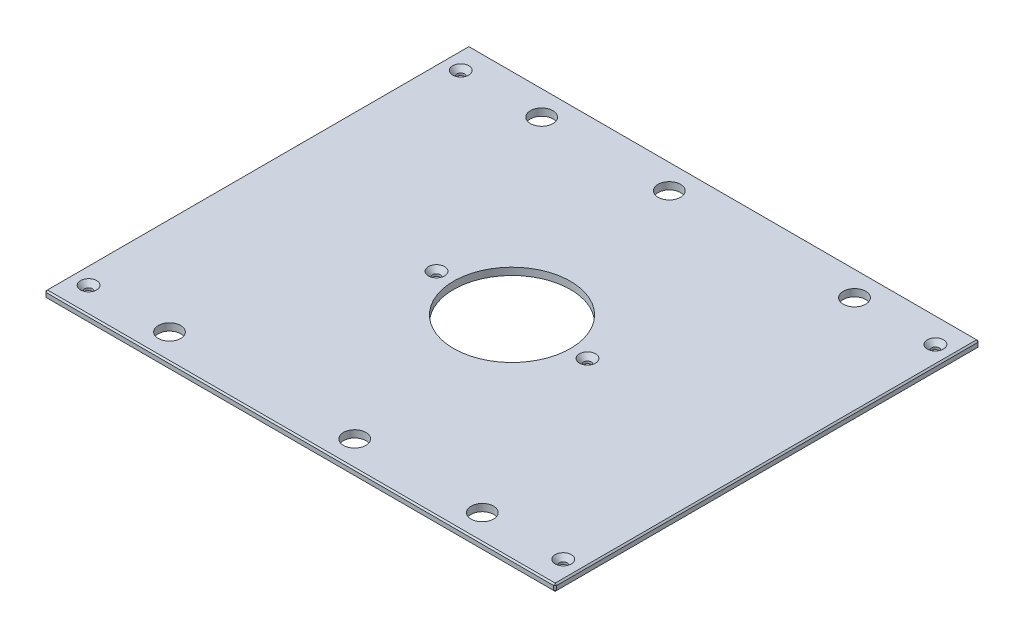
from build123d import *

# Parameters (mm, degrees)
SKETCH1_W                                     = 450.85
SKETCH1_H                                     = 374.65
BOSS_EXTRUDE1_DEPTH                           = 6.35
SKETCH13_R                                    = 51.562
CUT_EXTRUDE6_DEPTH                            = 294.167884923
F_25_32_0_78125_DIAMETER_HOLE1_D              = 19.84375
CHAMFER2_SIZE                                 = 1.27
CSK_FOR_1_4_FLAT_HEAD_MACHINE_SCREW1_AT_COUNT = 2
CSK_FOR_1_4_FLAT_HEAD_MACHINE_SCREW1_AT_PITCH = 328.60996
CSK_FOR_1_4_FLAT_HEAD_MACHINE_SCREW1_2_COUNT  = 2
CSK_FOR_1_4_FLAT_HEAD_MACHINE_SCREW1_2_PITCH  = 532.568601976
CSK_FOR_1_4_FLAT_HEAD_MACHINE_SCREW1_3_COUNT  = 2
CSK_FOR_1_4_FLAT_HEAD_MACHINE_SCREW1_3_PITCH  = 321.397537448
CSK_FOR_1_4_FLAT_HEAD_MACHINE_SCREW1_4_COUNT  = 2
CSK_FOR_1_4_FLAT_HEAD_MACHINE_SCREW1_4_PITCH  = 217.736979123
CSK_FOR_1_4_FLAT_HEAD_MACHINE_SCREW1_5_COUNT  = 2
CSK_FOR_1_4_FLAT_HEAD_MACHINE_SCREW1_5_PITCH  = 419.1
CSK_FOR_1_4_FLAT_HEAD_MACHINE_SCREW1_6_COUNT  = 2
CSK_FOR_1_4_FLAT_HEAD_MACHINE_SCREW1_6_PITCH  = 347.6625
CSK_FOR_1_4_FLAT_HEAD_MACHINE_SCREW1_7_COUNT  = 2
CSK_FOR_1_4_FLAT_HEAD_MACHINE_SCREW1_7_PITCH  = 478.386579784


with BuildPart() as part:
    # Sketch1 → Boss-Extrude1 (new body)
    with BuildSketch(Plane(origin=(0, 0, 0), x_dir=(1, 0, 0), z_dir=(0, 1, 0))):
        Rectangle(SKETCH1_W, SKETCH1_H)
    extrude(amount=BOSS_EXTRUDE1_DEPTH)

    # Sketch13 → Cut-Extrude6 (cut, through all)
    with BuildSketch(Plane(origin=(0, 6.35, 0), x_dir=(1, 0, 0), z_dir=(0, 1, 0))):
        with Locations(Location((0, 0, 0), (0, 0, 270))):
            Circle(SKETCH13_R)
    extrude(amount=-CUT_EXTRUDE6_DEPTH, mode=Mode.SUBTRACT)

    # 25_32 _0.78125_ Diameter Hole1 (through all)
    with Locations(Plane(origin=(0, 6.35, 0), x_dir=(1, 0, 0), z_dir=(0, 1, 0))):
        with Locations((138.1125, 164.30498), (-138.1125, 164.30498), (138.1125, -164.30498), (-138.1125, -164.30498), (-25.4, 164.30498), (25.4, -164.30498)):
            Hole(F_25_32_0_78125_DIAMETER_HOLE1_D / 2)

    # Chamfer2
    chamfer2_edges = [part.edges().sort_by_distance(p)[0] for p in [
        (225.425, 6.35, 0),
        (0, 6.35, -187.325),
        (-225.425, 6.35, 0),
        (0, 0, -187.325),
        (225.425, 0, 0),
        (0, 0, 187.325),
        (-225.425, 0, 0),
        (0, 6.35, 187.325),
        (-225.425, 3.175, -187.325),
        (225.425, 3.175, -187.325),
        (225.425, 3.175, 187.325),
        (-225.425, 3.175, 187.325),
    ]]
    chamfer(chamfer2_edges, length=CHAMFER2_SIZE)

    # Sketch24 → CSK for 1_4 Flat Head Machine Screw1 (revolve, cut)
    with BuildSketch(Plane(origin=(209.55, 6.35, -164.30498), x_dir=(0, 0, 1), z_dir=(1, 0, 0))):
        Polygon((0, 0), (0, 6.35), (3.3782, 6.35), (3.3782, 4.324464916), (7.1374, 0), align=None)
    csk_for_1_4_flat_head_machine_screw1 = revolve(axis=Axis((209.55, 12.7, -164.30498), (0, -1, 0)), mode=Mode.SUBTRACT)

    # CSK for 1_4 Flat Head Machine Screw1 at: CSK for 1_4 Flat Head Machine Screw1 ×2
    with Locations(*[(0, 0, i * CSK_FOR_1_4_FLAT_HEAD_MACHINE_SCREW1_AT_PITCH) for i in range(1, CSK_FOR_1_4_FLAT_HEAD_MACHINE_SCREW1_AT_COUNT)]):
        add(csk_for_1_4_flat_head_machine_screw1, mode=Mode.SUBTRACT)

    # CSK for 1_4 Flat Head Machine Screw1 2: CSK for 1_4 Flat Head Machine Screw1 ×2
    with Locations(*[Vector(-0.7869408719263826, 0, 0.6170284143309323) * (i * CSK_FOR_1_4_FLAT_HEAD_MACHINE_SCREW1_2_PITCH) for i in range(1, CSK_FOR_1_4_FLAT_HEAD_MACHINE_SCREW1_2_COUNT)]):
        add(csk_for_1_4_flat_head_machine_screw1, mode=Mode.SUBTRACT)

    # CSK for 1_4 Flat Head Machine Screw1 3: CSK for 1_4 Flat Head Machine Screw1 ×2
    with Locations(*[Vector(-0.8594496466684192, 0, 0.5112204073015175) * (i * CSK_FOR_1_4_FLAT_HEAD_MACHINE_SCREW1_3_PITCH) for i in range(1, CSK_FOR_1_4_FLAT_HEAD_MACHINE_SCREW1_3_COUNT)]):
        add(csk_for_1_4_flat_head_machine_screw1, mode=Mode.SUBTRACT)

    # CSK for 1_4 Flat Head Machine Screw1 4: CSK for 1_4 Flat Head Machine Screw1 ×2
    with Locations(*[Vector(-0.6561816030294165, 0, 0.7546030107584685) * (i * CSK_FOR_1_4_FLAT_HEAD_MACHINE_SCREW1_4_PITCH) for i in range(1, CSK_FOR_1_4_FLAT_HEAD_MACHINE_SCREW1_4_COUNT)]):
        add(csk_for_1_4_flat_head_machine_screw1, mode=Mode.SUBTRACT)

    # CSK for 1_4 Flat Head Machine Screw1 5: CSK for 1_4 Flat Head Machine Screw1 ×2
    with Locations(*[(-i * CSK_FOR_1_4_FLAT_HEAD_MACHINE_SCREW1_5_PITCH, 0, 0) for i in range(1, CSK_FOR_1_4_FLAT_HEAD_MACHINE_SCREW1_5_COUNT)]):
        add(csk_for_1_4_flat_head_machine_screw1, mode=Mode.SUBTRACT)

    # CSK for 1_4 Flat Head Machine Screw1 6: CSK for 1_4 Flat Head Machine Screw1 ×2
    with Locations(*[(-i * CSK_FOR_1_4_FLAT_HEAD_MACHINE_SCREW1_6_PITCH, 0, 0) for i in range(1, CSK_FOR_1_4_FLAT_HEAD_MACHINE_SCREW1_6_COUNT)]):
        add(csk_for_1_4_flat_head_machine_screw1, mode=Mode.SUBTRACT)

    # CSK for 1_4 Flat Head Machine Screw1 7: CSK for 1_4 Flat Head Machine Screw1 ×2
    with Locations(*[Vector(-0.7267396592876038, 0, 0.6869129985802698) * (i * CSK_FOR_1_4_FLAT_HEAD_MACHINE_SCREW1_7_PITCH) for i in range(1, CSK_FOR_1_4_FLAT_HEAD_MACHINE_SCREW1_7_COUNT)]):
        add(csk_for_1_4_flat_head_machine_screw1, mode=Mode.SUBTRACT)


solid = part.part
